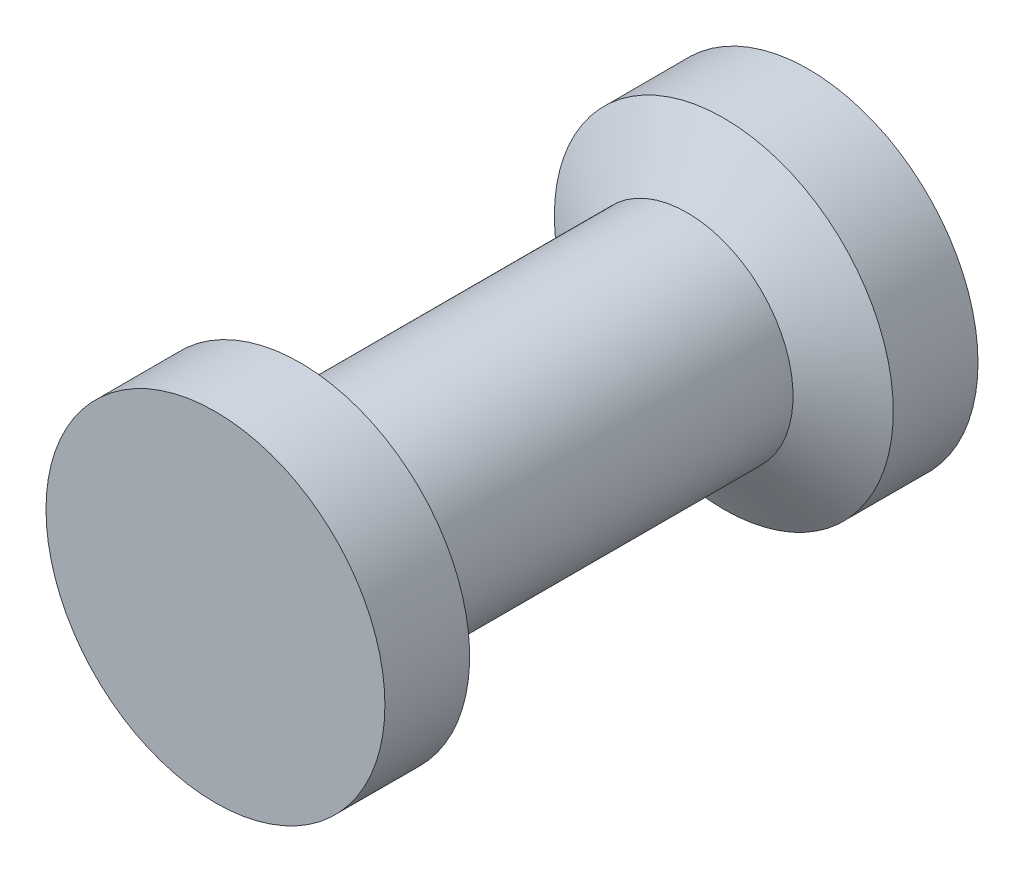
from build123d import *

# Parameters (mm, degrees)
ESQUISSE1_R        = 40
BOSS_EXTRU_1_DEPTH = 20
BOSS_EXTRU_2_START = 20
ESQUISSE2_R        = 25
BOSS_EXTRU_2_DEPTH = 100
BOSS_EXTRU_3_START = 120
ESQUISSE1_2_R      = 40
BOSS_EXTRU_3_DEPTH = 20


with BuildPart() as part:
    # Esquisse1 → Boss.-Extru.1 (new body)
    with BuildSketch(Plane.XY):
        Circle(ESQUISSE1_R)
    extrude(amount=BOSS_EXTRU_1_DEPTH)

    # Esquisse2 → Boss.-Extru.2 (add)
    with BuildSketch(Plane.XY.offset(BOSS_EXTRU_2_START)):
        Circle(ESQUISSE2_R)
    extrude(amount=BOSS_EXTRU_2_DEPTH)

    # Esquisse1_2 → Boss.-Extru.3 (add)
    with BuildSketch(Plane.XY.offset(BOSS_EXTRU_3_START)):
        Circle(ESQUISSE1_2_R)
    extrude(amount=BOSS_EXTRU_3_DEPTH)

    # Esquisse3 → R_volution1 (revolve)
    with BuildSketch(Plane(origin=(0, 0, 0), x_dir=(1, 0, 0), z_dir=(0, 1, 0))):
        Polygon((-40, -20), (-25, -28.660254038), (-25, -20), align=None)
        Polygon((-25, -120), (-40, -120), (-25, -111.339745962), align=None)
    revolve(axis=Axis((0, 0, -7), (0, 0, 1)))


solid = part.part
